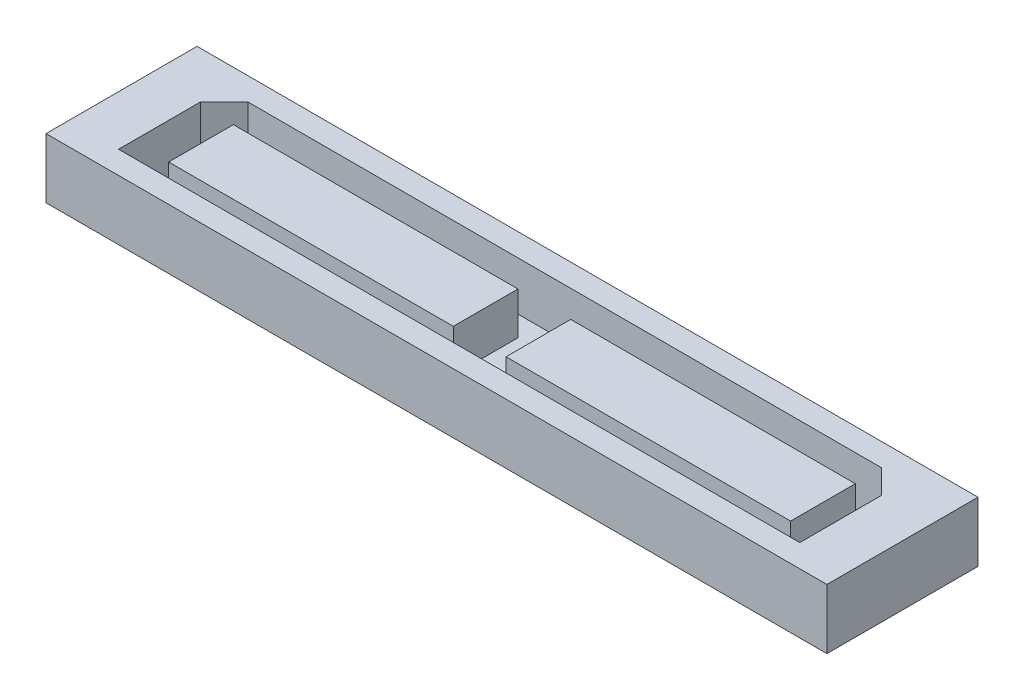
from build123d import *

# Parameters (mm, degrees)
SKETCH1_W          = 46
SKETCH1_H          = 8.9
EXTRUDE1_DEPTH     = 3.5306
SKETCH7_W          = 40.13073
SKETCH7_H          = 6.223
CUT_EXTRUDE1_DEPTH = 2.8702
SKETCH8_W          = 16.764
SKETCH8_H          = 3.81
EXTRUDE7_DEPTH     = 2.4892
CHAMFER2_SIZE      = 1.397


with BuildPart() as part:
    # Sketch1 → Extrude1 (new body)
    with BuildSketch(Plane(origin=(0, 3.6322, 0), x_dir=(-1, 0, 0), z_dir=(0, 1, 0))):
        Rectangle(SKETCH1_W, SKETCH1_H)
    extrude(amount=-EXTRUDE1_DEPTH)

    # Sketch7 → Cut-Extrude1 (cut)
    with BuildSketch(Plane(origin=(0, 3.6322, 0), x_dir=(-1, 0, 0), z_dir=(0, 1, 0))):
        Rectangle(SKETCH7_W, SKETCH7_H)
    extrude(amount=-CUT_EXTRUDE1_DEPTH, mode=Mode.SUBTRACT)

    # Sketch8 → Extrude7 (add)
    with BuildSketch(Plane(origin=(0, 0.762, 0), x_dir=(-1, 0, 0), z_dir=(0, 1, 0))):
        with Locations((-9.93521, 0)):
            Rectangle(SKETCH8_W, SKETCH8_H)
        with Locations((9.93521, 0)):
            Rectangle(SKETCH8_W, SKETCH8_H)
    extrude(amount=EXTRUDE7_DEPTH)

    # Chamfer2
    chamfer2_edges = [part.edges().sort_by_distance(p)[0] for p in [
        (-20.065365, 2.1971, -3.1115),
        (20.065365, 2.1971, -3.1115),
    ]]
    chamfer(chamfer2_edges, length=CHAMFER2_SIZE)


solid = part.part
